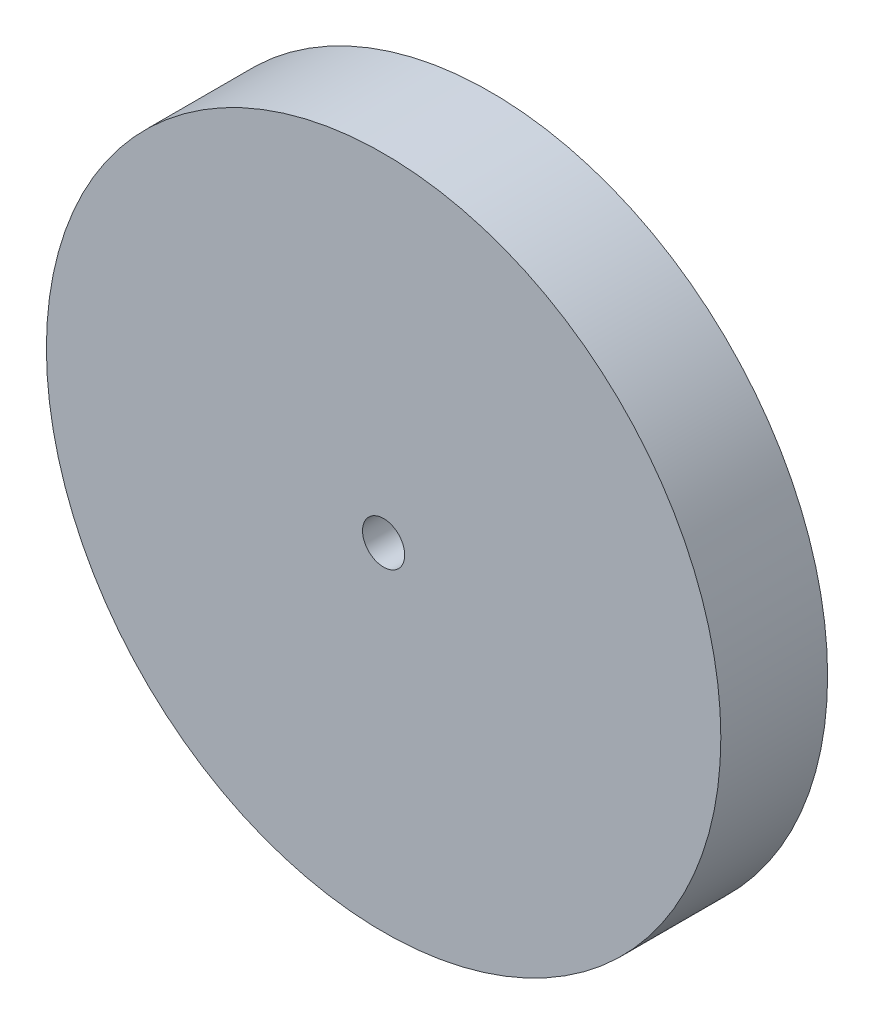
ISO-10303-21;
HEADER;
FILE_DESCRIPTION(('STEP AP214'),'2;1');
FILE_NAME('part.step','',(''),(''),'','','');
FILE_SCHEMA(('AUTOMOTIVE_DESIGN { 1 0 10303 214 1 1 1 1 }'));
ENDSEC;
DATA;
#1=APPLICATION_CONTEXT('core data for automotive mechanical design processes');
#2=APPLICATION_PROTOCOL_DEFINITION('international standard','automotive_design',2000,#1);
#3=PRODUCT_CONTEXT('',#1,'mechanical');
#4=PRODUCT('Part','Part','',(#3));
#5=PRODUCT_RELATED_PRODUCT_CATEGORY('part','',(#4));
#6=PRODUCT_DEFINITION_FORMATION('','',#4);
#7=PRODUCT_DEFINITION_CONTEXT('part definition',#1,'design');
#8=PRODUCT_DEFINITION('design','',#6,#7);
#9=PRODUCT_DEFINITION_SHAPE('','',#8);
#10=(LENGTH_UNIT() NAMED_UNIT(*) SI_UNIT(.MILLI.,.METRE.));
#11=(NAMED_UNIT(*) PLANE_ANGLE_UNIT() SI_UNIT($,.RADIAN.));
#12=(NAMED_UNIT(*) SI_UNIT($,.STERADIAN.) SOLID_ANGLE_UNIT());
#13=UNCERTAINTY_MEASURE_WITH_UNIT(LENGTH_MEASURE(1.E-05),#10,'distance_accuracy_value','');
#14=(GEOMETRIC_REPRESENTATION_CONTEXT(3) GLOBAL_UNCERTAINTY_ASSIGNED_CONTEXT((#13)) GLOBAL_UNIT_ASSIGNED_CONTEXT((#10,
#11,#12)) REPRESENTATION_CONTEXT('',''));
#15=CARTESIAN_POINT('',(0.,0.,0.));
#16=DIRECTION('',(0.,0.,1.));
#17=DIRECTION('',(1.,0.,0.));
#18=AXIS2_PLACEMENT_3D('',#15,#16,#17);
#19=CARTESIAN_POINT('',(0.,0.,-2.54));
#20=DIRECTION('',(0.,0.,1.));
#21=DIRECTION('',(1.,0.,0.));
#22=AXIS2_PLACEMENT_3D('',#19,#20,#21);
#23=PLANE('',#22);
#24=CARTESIAN_POINT('',(0.,0.,-2.54));
#25=DIRECTION('',(0.,0.,1.));
#26=DIRECTION('',(1.,0.,0.));
#27=AXIS2_PLACEMENT_3D('',#24,#25,#26);
#28=CIRCLE('',#27,2.38125);
#29=CARTESIAN_POINT('',(-2.38125,0.,-2.54));
#30=VERTEX_POINT('',#29);
#31=EDGE_CURVE('E99',#30,#30,#28,.T.);
#32=ORIENTED_EDGE('',*,*,#31,.T.);
#33=EDGE_LOOP('',(#32));
#34=FACE_BOUND('',#33,.T.);
#35=CARTESIAN_POINT('',(0.,0.,-2.54));
#36=DIRECTION('',(0.,0.,-1.));
#37=DIRECTION('',(-1.,0.,0.));
#38=AXIS2_PLACEMENT_3D('',#35,#36,#37);
#39=CIRCLE('',#38,9.525);
#40=CARTESIAN_POINT('',(-9.525,0.,-2.54));
#41=VERTEX_POINT('',#40);
#42=EDGE_CURVE('E108',#41,#41,#39,.T.);
#43=ORIENTED_EDGE('',*,*,#42,.T.);
#44=EDGE_LOOP('',(#43));
#45=FACE_BOUND('',#44,.T.);
#46=ADVANCED_FACE('F74',(#34,#45),#23,.F.);
#47=CARTESIAN_POINT('',(0.,0.,9.525));
#48=DIRECTION('',(0.,0.,1.));
#49=DIRECTION('',(1.,0.,0.));
#50=AXIS2_PLACEMENT_3D('',#47,#48,#49);
#51=PLANE('',#50);
#52=CARTESIAN_POINT('',(0.,0.,9.525));
#53=DIRECTION('',(0.,0.,1.));
#54=DIRECTION('',(1.,0.,0.));
#55=AXIS2_PLACEMENT_3D('',#52,#53,#54);
#56=CIRCLE('',#55,38.1);
#57=CARTESIAN_POINT('',(38.1,0.,9.525));
#58=VERTEX_POINT('',#57);
#59=EDGE_CURVE('E88',#58,#58,#56,.T.);
#60=ORIENTED_EDGE('',*,*,#59,.T.);
#61=EDGE_LOOP('',(#60));
#62=FACE_BOUND('',#61,.T.);
#63=CARTESIAN_POINT('',(0.,0.,9.525));
#64=DIRECTION('',(0.,0.,1.));
#65=DIRECTION('',(1.,0.,0.));
#66=AXIS2_PLACEMENT_3D('',#63,#64,#65);
#67=CIRCLE('',#66,2.38125);
#68=CARTESIAN_POINT('',(-2.38125,0.,9.525));
#69=VERTEX_POINT('',#68);
#70=EDGE_CURVE('E93',#69,#69,#67,.T.);
#71=ORIENTED_EDGE('',*,*,#70,.F.);
#72=EDGE_LOOP('',(#71));
#73=FACE_BOUND('',#72,.T.);
#74=ADVANCED_FACE('F127',(#62,#73),#51,.T.);
#75=CARTESIAN_POINT('',(0.,0.,9.525));
#76=DIRECTION('',(0.,0.,-1.));
#77=DIRECTION('',(-1.,0.,0.));
#78=AXIS2_PLACEMENT_3D('',#75,#76,#77);
#79=CYLINDRICAL_SURFACE('',#78,2.38125);
#80=CARTESIAN_POINT('',(-2.38125,0.,9.525));
#81=CARTESIAN_POINT('',(-2.38125,0.,9.39932291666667));
#82=CARTESIAN_POINT('',(-2.38125,0.,9.27364583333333));
#83=CARTESIAN_POINT('',(-2.38125,0.,9.02229166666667));
#84=CARTESIAN_POINT('',(-2.38125,0.,8.89661458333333));
#85=CARTESIAN_POINT('',(-2.38125,0.,8.64526041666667));
#86=CARTESIAN_POINT('',(-2.38125,0.,8.51958333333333));
#87=CARTESIAN_POINT('',(-2.38125,0.,8.26822916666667));
#88=CARTESIAN_POINT('',(-2.38125,0.,8.14255208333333));
#89=CARTESIAN_POINT('',(-2.38125,0.,7.89119791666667));
#90=CARTESIAN_POINT('',(-2.38125,0.,7.76552083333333));
#91=CARTESIAN_POINT('',(-2.38125,0.,7.51416666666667));
#92=CARTESIAN_POINT('',(-2.38125,0.,7.38848958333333));
#93=CARTESIAN_POINT('',(-2.38125,0.,7.13713541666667));
#94=CARTESIAN_POINT('',(-2.38125,0.,7.01145833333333));
#95=CARTESIAN_POINT('',(-2.38125,0.,6.76010416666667));
#96=CARTESIAN_POINT('',(-2.38125,0.,6.63442708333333));
#97=CARTESIAN_POINT('',(-2.38125,0.,6.38307291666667));
#98=CARTESIAN_POINT('',(-2.38125,0.,6.25739583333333));
#99=CARTESIAN_POINT('',(-2.38125,0.,6.00604166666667));
#100=CARTESIAN_POINT('',(-2.38125,0.,5.88036458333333));
#101=CARTESIAN_POINT('',(-2.38125,0.,5.62901041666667));
#102=CARTESIAN_POINT('',(-2.38125,0.,5.50333333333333));
#103=CARTESIAN_POINT('',(-2.38125,0.,5.25197916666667));
#104=CARTESIAN_POINT('',(-2.38125,0.,5.12630208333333));
#105=CARTESIAN_POINT('',(-2.38125,0.,4.87494791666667));
#106=CARTESIAN_POINT('',(-2.38125,0.,4.74927083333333));
#107=CARTESIAN_POINT('',(-2.38125,0.,4.49791666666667));
#108=CARTESIAN_POINT('',(-2.38125,0.,4.37223958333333));
#109=CARTESIAN_POINT('',(-2.38125,0.,4.12088541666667));
#110=CARTESIAN_POINT('',(-2.38125,0.,3.99520833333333));
#111=CARTESIAN_POINT('',(-2.38125,0.,3.74385416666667));
#112=CARTESIAN_POINT('',(-2.38125,0.,3.61817708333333));
#113=CARTESIAN_POINT('',(-2.38125,0.,3.36682291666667));
#114=CARTESIAN_POINT('',(-2.38125,0.,3.24114583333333));
#115=CARTESIAN_POINT('',(-2.38125,0.,2.98979166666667));
#116=CARTESIAN_POINT('',(-2.38125,0.,2.86411458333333));
#117=CARTESIAN_POINT('',(-2.38125,0.,2.61276041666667));
#118=CARTESIAN_POINT('',(-2.38125,0.,2.48708333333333));
#119=CARTESIAN_POINT('',(-2.38125,0.,2.23572916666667));
#120=CARTESIAN_POINT('',(-2.38125,0.,2.11005208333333));
#121=CARTESIAN_POINT('',(-2.38125,0.,1.85869791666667));
#122=CARTESIAN_POINT('',(-2.38125,0.,1.73302083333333));
#123=CARTESIAN_POINT('',(-2.38125,0.,1.48166666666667));
#124=CARTESIAN_POINT('',(-2.38125,0.,1.35598958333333));
#125=CARTESIAN_POINT('',(-2.38125,0.,1.10463541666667));
#126=CARTESIAN_POINT('',(-2.38125,0.,0.978958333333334));
#127=CARTESIAN_POINT('',(-2.38125,0.,0.727604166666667));
#128=CARTESIAN_POINT('',(-2.38125,0.,0.601927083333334));
#129=CARTESIAN_POINT('',(-2.38125,0.,0.350572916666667));
#130=CARTESIAN_POINT('',(-2.38125,0.,0.224895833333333));
#131=CARTESIAN_POINT('',(-2.38125,0.,-0.0264583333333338));
#132=CARTESIAN_POINT('',(-2.38125,0.,-0.152135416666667));
#133=CARTESIAN_POINT('',(-2.38125,0.,-0.403489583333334));
#134=CARTESIAN_POINT('',(-2.38125,0.,-0.529166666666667));
#135=CARTESIAN_POINT('',(-2.38125,0.,-0.780520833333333));
#136=CARTESIAN_POINT('',(-2.38125,0.,-0.906197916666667));
#137=CARTESIAN_POINT('',(-2.38125,0.,-1.15755208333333));
#138=CARTESIAN_POINT('',(-2.38125,0.,-1.28322916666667));
#139=CARTESIAN_POINT('',(-2.38125,0.,-1.53458333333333));
#140=CARTESIAN_POINT('',(-2.38125,0.,-1.66026041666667));
#141=CARTESIAN_POINT('',(-2.38125,0.,-1.91161458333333));
#142=CARTESIAN_POINT('',(-2.38125,0.,-2.03729166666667));
#143=CARTESIAN_POINT('',(-2.38125,0.,-2.28864583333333));
#144=CARTESIAN_POINT('',(-2.38125,0.,-2.41432291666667));
#145=CARTESIAN_POINT('',(-2.38125,0.,-2.54));
#146=B_SPLINE_CURVE_WITH_KNOTS('',3,(#80,#81,#82,#83,#84,#85,#86,#87,#88,#89,#90,#91,#92,#93,
#94,#95,#96,#97,#98,#99,#100,#101,#102,#103,#104,#105,#106,#107,#108,#109,#110,#111,#112,#113,
#114,#115,#116,#117,#118,#119,#120,#121,#122,#123,#124,#125,#126,#127,#128,#129,#130,#131,#132,
#133,#134,#135,#136,#137,#138,#139,#140,#141,#142,#143,#144,#145),.UNSPECIFIED.,.F.,.F.,(4,2,2,
2,2,2,2,2,2,2,2,2,2,2,2,2,2,2,2,2,2,2,2,2,2,2,2,2,2,2,2,2,4),(0.,0.377031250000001,
0.754062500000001,1.13109375,1.508125,1.88515625,2.2621875,2.63921875,3.01625,3.39328125,
3.7703125,4.14734375,4.524375,4.90140625,5.2784375,5.65546875,6.0325,6.40953125,6.7865625,
7.16359375,7.540625,7.91765625,8.2946875,8.67171875,9.04875,9.42578125,9.8028125,10.17984375,
10.556875,10.93390625,11.3109375,11.68796875,12.065),.UNSPECIFIED.);
#147=EDGE_CURVE('BSEAM134',#69,#30,#146,.T.);
#148=ORIENTED_EDGE('',*,*,#70,.T.);
#149=ORIENTED_EDGE('',*,*,#31,.F.);
#150=ORIENTED_EDGE('',*,*,#147,.T.);
#151=ORIENTED_EDGE('',*,*,#147,.F.);
#152=EDGE_LOOP('',(#148,#150,#149,#151));
#153=FACE_BOUND('',#152,.T.);
#154=ADVANCED_FACE('F134',(#153),#79,.F.);
#155=CARTESIAN_POINT('',(0.,0.,-2.54));
#156=DIRECTION('',(0.,0.,1.));
#157=DIRECTION('',(1.,0.,0.));
#158=AXIS2_PLACEMENT_3D('',#155,#156,#157);
#159=CYLINDRICAL_SURFACE('',#158,38.1);
#160=CARTESIAN_POINT('',(0.,0.,-2.54));
#161=DIRECTION('',(0.,0.,1.));
#162=DIRECTION('',(1.,0.,0.));
#163=AXIS2_PLACEMENT_3D('',#160,#161,#162);
#164=CIRCLE('',#163,38.1);
#165=CARTESIAN_POINT('',(38.1,0.,-2.54));
#166=VERTEX_POINT('',#165);
#167=EDGE_CURVE('E83',#166,#166,#164,.T.);
#168=ORIENTED_EDGE('',*,*,#167,.T.);
#169=EDGE_LOOP('',(#168));
#170=FACE_BOUND('',#169,.T.);
#171=ORIENTED_EDGE('',*,*,#59,.F.);
#172=EDGE_LOOP('',(#171));
#173=FACE_BOUND('',#172,.T.);
#174=ADVANCED_FACE('F138',(#170,#173),#159,.T.);
#175=CARTESIAN_POINT('',(0.,0.,-2.54));
#176=DIRECTION('',(0.,0.,-1.));
#177=DIRECTION('',(-1.,0.,0.));
#178=AXIS2_PLACEMENT_3D('',#175,#176,#177);
#179=CIRCLE('',#178,28.575);
#180=CARTESIAN_POINT('',(-28.575,0.,-2.54));
#181=VERTEX_POINT('',#180);
#182=EDGE_CURVE('E104',#181,#181,#179,.T.);
#183=ORIENTED_EDGE('',*,*,#182,.F.);
#184=EDGE_LOOP('',(#183));
#185=FACE_BOUND('',#184,.T.);
#186=ORIENTED_EDGE('',*,*,#167,.F.);
#187=EDGE_LOOP('',(#186));
#188=FACE_BOUND('',#187,.T.);
#189=ADVANCED_FACE('F130',(#185,#188),#23,.F.);
#190=CARTESIAN_POINT('',(0.,0.,3.81));
#191=DIRECTION('',(0.,0.,-1.));
#192=DIRECTION('',(-1.,0.,0.));
#193=AXIS2_PLACEMENT_3D('',#190,#191,#192);
#194=CYLINDRICAL_SURFACE('',#193,28.575);
#195=CARTESIAN_POINT('',(0.,0.,3.81));
#196=DIRECTION('',(0.,0.,-1.));
#197=DIRECTION('',(-1.,0.,0.));
#198=AXIS2_PLACEMENT_3D('',#195,#196,#197);
#199=CIRCLE('',#198,28.575);
#200=CARTESIAN_POINT('',(-28.575,0.,3.81));
#201=VERTEX_POINT('',#200);
#202=EDGE_CURVE('E103',#201,#201,#199,.T.);
#203=ORIENTED_EDGE('',*,*,#202,.F.);
#204=EDGE_LOOP('',(#203));
#205=FACE_BOUND('',#204,.T.);
#206=ORIENTED_EDGE('',*,*,#182,.T.);
#207=EDGE_LOOP('',(#206));
#208=FACE_BOUND('',#207,.T.);
#209=ADVANCED_FACE('F124',(#205,#208),#194,.F.);
#210=CARTESIAN_POINT('',(0.,0.,3.81));
#211=DIRECTION('',(0.,0.,-1.));
#212=DIRECTION('',(-1.,0.,0.));
#213=AXIS2_PLACEMENT_3D('',#210,#211,#212);
#214=PLANE('',#213);
#215=CARTESIAN_POINT('',(0.,0.,3.81));
#216=DIRECTION('',(0.,0.,-1.));
#217=DIRECTION('',(-1.,0.,0.));
#218=AXIS2_PLACEMENT_3D('',#215,#216,#217);
#219=CIRCLE('',#218,15.875);
#220=CARTESIAN_POINT('',(-15.875,0.,3.81));
#221=VERTEX_POINT('',#220);
#222=EDGE_CURVE('E11',#221,#221,#219,.F.);
#223=ORIENTED_EDGE('',*,*,#222,.T.);
#224=EDGE_LOOP('',(#223));
#225=FACE_BOUND('',#224,.T.);
#226=ORIENTED_EDGE('',*,*,#202,.T.);
#227=EDGE_LOOP('',(#226));
#228=FACE_BOUND('',#227,.T.);
#229=ADVANCED_FACE('F118',(#225,#228),#214,.T.);
#230=CARTESIAN_POINT('',(0.,0.,-2.53999999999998));
#231=DIRECTION('',(0.,0.,1.));
#232=DIRECTION('',(1.,0.,0.));
#233=AXIS2_PLACEMENT_3D('',#230,#231,#232);
#234=CONICAL_SURFACE('',#233,9.525,0.785398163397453);
#235=ORIENTED_EDGE('',*,*,#222,.F.);
#236=EDGE_LOOP('',(#235));
#237=FACE_BOUND('',#236,.T.);
#238=ORIENTED_EDGE('',*,*,#42,.F.);
#239=EDGE_LOOP('',(#238));
#240=FACE_BOUND('',#239,.T.);
#241=ADVANCED_FACE('F77',(#237,#240),#234,.T.);
#242=CLOSED_SHELL('',(#46,#74,#154,#174,#189,#209,#229,#241));
#243=MANIFOLD_SOLID_BREP('B2',#242);
#244=ADVANCED_BREP_SHAPE_REPRESENTATION('',(#18,#243),#14);
#245=SHAPE_DEFINITION_REPRESENTATION(#9,#244);
ENDSEC;
END-ISO-10303-21;
